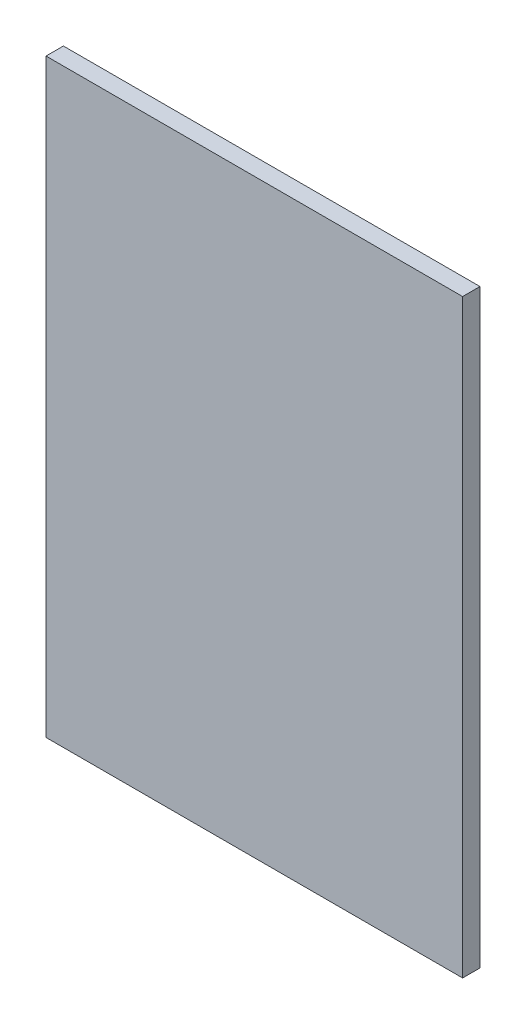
from build123d import *

# Parameters (mm, degrees)
ESQUISSE1_W          = 240
ESQUISSE1_H          = 340
BASE_EXTRUSION_DEPTH = 10


with BuildPart() as part:
    # Esquisse1 → Base-Extrusion (new body)
    with BuildSketch(Plane.XY):
        with Locations((11.425467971, -61.16753199)):
            Rectangle(ESQUISSE1_W, ESQUISSE1_H)
    extrude(amount=BASE_EXTRUSION_DEPTH)


solid = part.part
